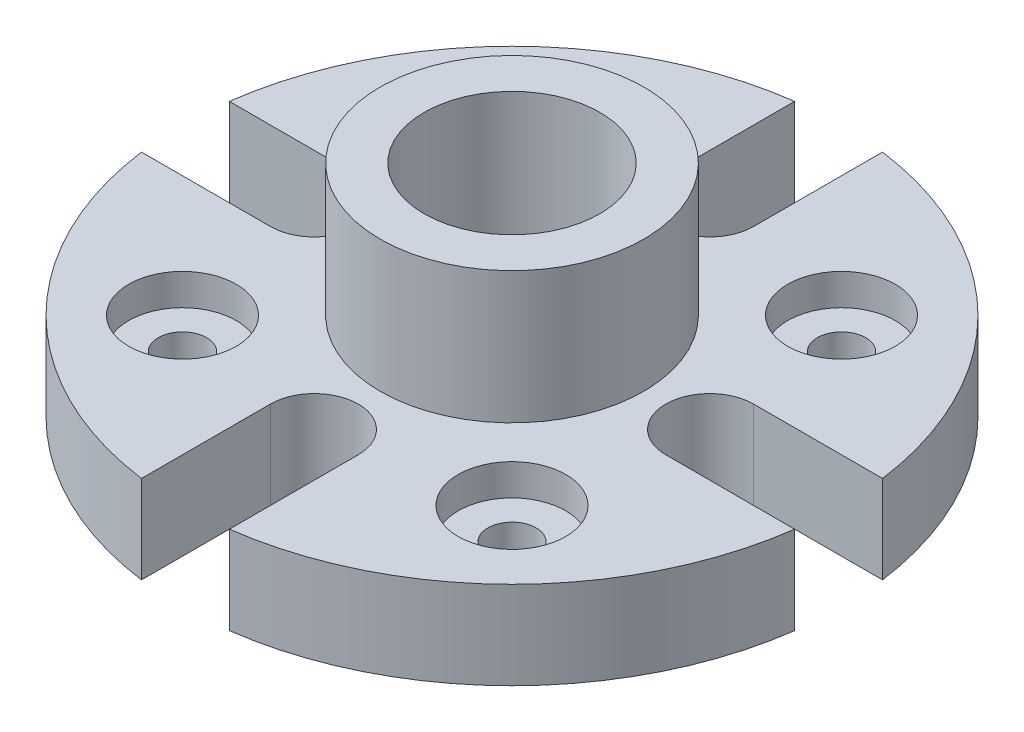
ISO-10303-21;
HEADER;
FILE_DESCRIPTION(('STEP AP214'),'2;1');
FILE_NAME('part.step','',(''),(''),'','','');
FILE_SCHEMA(('AUTOMOTIVE_DESIGN { 1 0 10303 214 1 1 1 1 }'));
ENDSEC;
DATA;
#1=APPLICATION_CONTEXT('core data for automotive mechanical design processes');
#2=APPLICATION_PROTOCOL_DEFINITION('international standard','automotive_design',2000,#1);
#3=PRODUCT_CONTEXT('',#1,'mechanical');
#4=PRODUCT('Part','Part','',(#3));
#5=PRODUCT_RELATED_PRODUCT_CATEGORY('part','',(#4));
#6=PRODUCT_DEFINITION_FORMATION('','',#4);
#7=PRODUCT_DEFINITION_CONTEXT('part definition',#1,'design');
#8=PRODUCT_DEFINITION('design','',#6,#7);
#9=PRODUCT_DEFINITION_SHAPE('','',#8);
#10=(LENGTH_UNIT() NAMED_UNIT(*) SI_UNIT(.MILLI.,.METRE.));
#11=(NAMED_UNIT(*) PLANE_ANGLE_UNIT() SI_UNIT($,.RADIAN.));
#12=(NAMED_UNIT(*) SI_UNIT($,.STERADIAN.) SOLID_ANGLE_UNIT());
#13=UNCERTAINTY_MEASURE_WITH_UNIT(LENGTH_MEASURE(1.E-05),#10,'distance_accuracy_value','');
#14=(GEOMETRIC_REPRESENTATION_CONTEXT(3) GLOBAL_UNCERTAINTY_ASSIGNED_CONTEXT((#13)) GLOBAL_UNIT_ASSIGNED_CONTEXT((#10,
#11,#12)) REPRESENTATION_CONTEXT('',''));
#15=CARTESIAN_POINT('',(0.,0.,0.));
#16=DIRECTION('',(0.,0.,1.));
#17=DIRECTION('',(1.,0.,0.));
#18=AXIS2_PLACEMENT_3D('',#15,#16,#17);
#19=CARTESIAN_POINT('',(0.,10.,0.));
#20=DIRECTION('',(0.,-1.,0.));
#21=DIRECTION('',(0.,0.,-1.));
#22=AXIS2_PLACEMENT_3D('',#19,#20,#21);
#23=CYLINDRICAL_SURFACE('',#22,37.5);
#24=CARTESIAN_POINT('',(0.,0.,0.));
#25=DIRECTION('',(0.,1.,0.));
#26=DIRECTION('',(0.,0.,1.));
#27=AXIS2_PLACEMENT_3D('',#24,#25,#26);
#28=CIRCLE('',#27,37.5);
#29=CARTESIAN_POINT('',(-5.,0.,-37.1651718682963));
#30=VERTEX_POINT('',#29);
#31=CARTESIAN_POINT('',(-37.1651718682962,0.,-5.00000000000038));
#32=VERTEX_POINT('',#31);
#33=EDGE_CURVE('E183',#30,#32,#28,.T.);
#34=ORIENTED_EDGE('',*,*,#33,.T.);
#35=DIRECTION('',(0.,1.,0.));
#36=VECTOR('',#35,1.);
#37=CARTESIAN_POINT('',(-37.1651718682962,0.,-5.00000000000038));
#38=LINE('',#37,#36);
#39=CARTESIAN_POINT('',(-37.1651718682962,10.,-5.00000000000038));
#40=VERTEX_POINT('',#39);
#41=EDGE_CURVE('E297',#32,#40,#38,.T.);
#42=ORIENTED_EDGE('',*,*,#41,.T.);
#43=CARTESIAN_POINT('',(0.,10.,0.));
#44=DIRECTION('',(0.,1.,0.));
#45=DIRECTION('',(0.,0.,1.));
#46=AXIS2_PLACEMENT_3D('',#43,#44,#45);
#47=CIRCLE('',#46,37.5);
#48=CARTESIAN_POINT('',(-5.,10.,-37.1651718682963));
#49=VERTEX_POINT('',#48);
#50=EDGE_CURVE('E11',#49,#40,#47,.T.);
#51=ORIENTED_EDGE('',*,*,#50,.F.);
#52=DIRECTION('',(0.,1.,0.));
#53=VECTOR('',#52,1.);
#54=CARTESIAN_POINT('',(-5.,0.,-37.1651718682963));
#55=LINE('',#54,#53);
#56=EDGE_CURVE('E214',#30,#49,#55,.T.);
#57=ORIENTED_EDGE('',*,*,#56,.F.);
#58=EDGE_LOOP('',(#34,#42,#51,#57));
#59=FACE_BOUND('',#58,.T.);
#60=ADVANCED_FACE('F37',(#59),#23,.T.);
#61=CARTESIAN_POINT('',(-37.1651718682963,10.,4.99999999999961));
#62=VERTEX_POINT('',#61);
#63=CARTESIAN_POINT('',(-5.00000000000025,10.,37.1651718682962));
#64=VERTEX_POINT('',#63);
#65=EDGE_CURVE('E45',#62,#64,#47,.T.);
#66=ORIENTED_EDGE('',*,*,#65,.F.);
#67=DIRECTION('',(0.,1.,0.));
#68=VECTOR('',#67,1.);
#69=CARTESIAN_POINT('',(-37.1651718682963,0.,4.99999999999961));
#70=LINE('',#69,#68);
#71=CARTESIAN_POINT('',(-37.1651718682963,0.,4.99999999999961));
#72=VERTEX_POINT('',#71);
#73=EDGE_CURVE('E151',#72,#62,#70,.T.);
#74=ORIENTED_EDGE('',*,*,#73,.F.);
#75=CARTESIAN_POINT('',(-5.00000000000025,0.,37.1651718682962));
#76=VERTEX_POINT('',#75);
#77=EDGE_CURVE('E189',#72,#76,#28,.T.);
#78=ORIENTED_EDGE('',*,*,#77,.T.);
#79=DIRECTION('',(0.,1.,0.));
#80=VECTOR('',#79,1.);
#81=CARTESIAN_POINT('',(-5.00000000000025,0.,37.1651718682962));
#82=LINE('',#81,#80);
#83=EDGE_CURVE('E177',#76,#64,#82,.T.);
#84=ORIENTED_EDGE('',*,*,#83,.T.);
#85=EDGE_LOOP('',(#66,#74,#78,#84));
#86=FACE_BOUND('',#85,.T.);
#87=ADVANCED_FACE('F175',(#86),#23,.T.);
#88=CARTESIAN_POINT('',(4.99999999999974,10.,37.1651718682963));
#89=VERTEX_POINT('',#88);
#90=CARTESIAN_POINT('',(37.1651718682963,10.,5.00000000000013));
#91=VERTEX_POINT('',#90);
#92=EDGE_CURVE('E178',#89,#91,#47,.T.);
#93=ORIENTED_EDGE('',*,*,#92,.F.);
#94=DIRECTION('',(0.,1.,0.));
#95=VECTOR('',#94,1.);
#96=CARTESIAN_POINT('',(4.99999999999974,0.,37.1651718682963));
#97=LINE('',#96,#95);
#98=CARTESIAN_POINT('',(4.99999999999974,0.,37.1651718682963));
#99=VERTEX_POINT('',#98);
#100=EDGE_CURVE('E276',#99,#89,#97,.T.);
#101=ORIENTED_EDGE('',*,*,#100,.F.);
#102=CARTESIAN_POINT('',(37.1651718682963,0.,5.00000000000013));
#103=VERTEX_POINT('',#102);
#104=EDGE_CURVE('E195',#99,#103,#28,.T.);
#105=ORIENTED_EDGE('',*,*,#104,.T.);
#106=DIRECTION('',(0.,1.,0.));
#107=VECTOR('',#106,1.);
#108=CARTESIAN_POINT('',(37.1651718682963,0.,5.00000000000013));
#109=LINE('',#108,#107);
#110=EDGE_CURVE('E250',#103,#91,#109,.T.);
#111=ORIENTED_EDGE('',*,*,#110,.T.);
#112=EDGE_LOOP('',(#93,#101,#105,#111));
#113=FACE_BOUND('',#112,.T.);
#114=ADVANCED_FACE('F374',(#113),#23,.T.);
#115=CARTESIAN_POINT('',(0.,10.,0.));
#116=DIRECTION('',(0.,1.,0.));
#117=DIRECTION('',(0.,0.,1.));
#118=AXIS2_PLACEMENT_3D('',#115,#116,#117);
#119=PLANE('',#118);
#120=CARTESIAN_POINT('',(-18.7500000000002,10.,18.7499999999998));
#121=DIRECTION('',(0.,1.,0.));
#122=DIRECTION('',(0.,0.,1.));
#123=AXIS2_PLACEMENT_3D('',#120,#121,#122);
#124=CIRCLE('',#123,6.12);
#125=CARTESIAN_POINT('',(-18.7500000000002,10.,24.8699999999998));
#126=VERTEX_POINT('',#125);
#127=EDGE_CURVE('E333',#126,#126,#124,.T.);
#128=ORIENTED_EDGE('',*,*,#127,.F.);
#129=EDGE_LOOP('',(#128));
#130=FACE_BOUND('',#129,.T.);
#131=CARTESIAN_POINT('',(18.7499999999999,10.,18.7500000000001));
#132=DIRECTION('',(0.,1.,0.));
#133=DIRECTION('',(0.,0.,1.));
#134=AXIS2_PLACEMENT_3D('',#131,#132,#133);
#135=CIRCLE('',#134,6.12);
#136=CARTESIAN_POINT('',(18.7499999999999,10.,24.8700000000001));
#137=VERTEX_POINT('',#136);
#138=EDGE_CURVE('E321',#137,#137,#135,.T.);
#139=ORIENTED_EDGE('',*,*,#138,.F.);
#140=EDGE_LOOP('',(#139));
#141=FACE_BOUND('',#140,.T.);
#142=CARTESIAN_POINT('',(18.7500000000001,10.,-18.7499999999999));
#143=DIRECTION('',(0.,1.,0.));
#144=DIRECTION('',(0.,0.,1.));
#145=AXIS2_PLACEMENT_3D('',#142,#143,#144);
#146=CIRCLE('',#145,6.12);
#147=CARTESIAN_POINT('',(18.7500000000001,10.,-12.6299999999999));
#148=VERTEX_POINT('',#147);
#149=EDGE_CURVE('E172',#148,#148,#146,.T.);
#150=ORIENTED_EDGE('',*,*,#149,.F.);
#151=EDGE_LOOP('',(#150));
#152=FACE_BOUND('',#151,.T.);
#153=DIRECTION('',(-1.,0.,0.));
#154=VECTOR('',#153,1.);
#155=CARTESIAN_POINT('',(-37.1651718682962,10.,-5.00000000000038));
#156=LINE('',#155,#154);
#157=CARTESIAN_POINT('',(-22.5,10.,-5.00000000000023));
#158=VERTEX_POINT('',#157);
#159=EDGE_CURVE('E307',#158,#40,#156,.T.);
#160=ORIENTED_EDGE('',*,*,#159,.F.);
#161=CARTESIAN_POINT('',(-22.5,10.,-2.32919762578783E-13));
#162=DIRECTION('',(0.,1.,0.));
#163=DIRECTION('',(1.,0.,0.));
#164=AXIS2_PLACEMENT_3D('',#161,#162,#163);
#165=CIRCLE('',#164,5.);
#166=CARTESIAN_POINT('',(-22.5000000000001,10.,4.99999999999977));
#167=VERTEX_POINT('',#166);
#168=EDGE_CURVE('E171',#167,#158,#165,.T.);
#169=ORIENTED_EDGE('',*,*,#168,.F.);
#170=DIRECTION('',(1.,0.,0.));
#171=VECTOR('',#170,1.);
#172=CARTESIAN_POINT('',(-37.1651718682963,10.,4.99999999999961));
#173=LINE('',#172,#171);
#174=EDGE_CURVE('E154',#62,#167,#173,.T.);
#175=ORIENTED_EDGE('',*,*,#174,.F.);
#176=ORIENTED_EDGE('',*,*,#65,.T.);
#177=DIRECTION('',(0.,0.,1.));
#178=VECTOR('',#177,1.);
#179=CARTESIAN_POINT('',(-5.00000000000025,10.,37.1651718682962));
#180=LINE('',#179,#178);
#181=CARTESIAN_POINT('',(-5.00000000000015,10.,22.5));
#182=VERTEX_POINT('',#181);
#183=EDGE_CURVE('E290',#182,#64,#180,.T.);
#184=ORIENTED_EDGE('',*,*,#183,.F.);
#185=CARTESIAN_POINT('',(-1.54361386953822E-13,10.,22.5));
#186=DIRECTION('',(0.,1.,0.));
#187=DIRECTION('',(0.,0.,-1.));
#188=AXIS2_PLACEMENT_3D('',#185,#186,#187);
#189=CIRCLE('',#188,5.);
#190=CARTESIAN_POINT('',(4.99999999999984,10.,22.5));
#191=VERTEX_POINT('',#190);
#192=EDGE_CURVE('E292',#191,#182,#189,.T.);
#193=ORIENTED_EDGE('',*,*,#192,.F.);
#194=DIRECTION('',(0.,0.,-1.));
#195=VECTOR('',#194,1.);
#196=CARTESIAN_POINT('',(4.99999999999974,10.,37.1651718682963));
#197=LINE('',#196,#195);
#198=EDGE_CURVE('E295',#89,#191,#197,.T.);
#199=ORIENTED_EDGE('',*,*,#198,.F.);
#200=ORIENTED_EDGE('',*,*,#92,.T.);
#201=DIRECTION('',(1.,0.,0.));
#202=VECTOR('',#201,1.);
#203=CARTESIAN_POINT('',(37.1651718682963,10.,5.00000000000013));
#204=LINE('',#203,#202);
#205=CARTESIAN_POINT('',(22.5,10.,5.00000000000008));
#206=VERTEX_POINT('',#205);
#207=EDGE_CURVE('E268',#206,#91,#204,.T.);
#208=ORIENTED_EDGE('',*,*,#207,.F.);
#209=CARTESIAN_POINT('',(22.5,10.,0.));
#210=DIRECTION('',(0.,1.,0.));
#211=DIRECTION('',(-1.,0.,0.));
#212=AXIS2_PLACEMENT_3D('',#209,#210,#211);
#213=CIRCLE('',#212,5.);
#214=CARTESIAN_POINT('',(22.5,10.,-4.99999999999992));
#215=VERTEX_POINT('',#214);
#216=EDGE_CURVE('E270',#215,#206,#213,.T.);
#217=ORIENTED_EDGE('',*,*,#216,.F.);
#218=DIRECTION('',(-1.,0.,0.));
#219=VECTOR('',#218,1.);
#220=CARTESIAN_POINT('',(37.1651718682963,10.,-4.99999999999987));
#221=LINE('',#220,#219);
#222=CARTESIAN_POINT('',(37.1651718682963,10.,-4.99999999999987));
#223=VERTEX_POINT('',#222);
#224=EDGE_CURVE('E273',#223,#215,#221,.T.);
#225=ORIENTED_EDGE('',*,*,#224,.F.);
#226=CARTESIAN_POINT('',(4.99999999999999,10.,-37.1651718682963));
#227=VERTEX_POINT('',#226);
#228=EDGE_CURVE('E46',#223,#227,#47,.T.);
#229=ORIENTED_EDGE('',*,*,#228,.T.);
#230=DIRECTION('',(0.,0.,-1.));
#231=VECTOR('',#230,1.);
#232=CARTESIAN_POINT('',(4.99999999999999,10.,-37.1651718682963));
#233=LINE('',#232,#231);
#234=CARTESIAN_POINT('',(5.,10.,-22.5));
#235=VERTEX_POINT('',#234);
#236=EDGE_CURVE('E230',#235,#227,#233,.T.);
#237=ORIENTED_EDGE('',*,*,#236,.F.);
#238=CARTESIAN_POINT('',(0.,10.,-22.5));
#239=DIRECTION('',(0.,1.,0.));
#240=DIRECTION('',(0.,0.,1.));
#241=AXIS2_PLACEMENT_3D('',#238,#239,#240);
#242=CIRCLE('',#241,5.);
#243=CARTESIAN_POINT('',(-5.,10.,-22.5));
#244=VERTEX_POINT('',#243);
#245=EDGE_CURVE('E232',#244,#235,#242,.T.);
#246=ORIENTED_EDGE('',*,*,#245,.F.);
#247=DIRECTION('',(0.,0.,1.));
#248=VECTOR('',#247,1.);
#249=CARTESIAN_POINT('',(-5.,10.,-37.1651718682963));
#250=LINE('',#249,#248);
#251=EDGE_CURVE('E235',#49,#244,#250,.T.);
#252=ORIENTED_EDGE('',*,*,#251,.F.);
#253=ORIENTED_EDGE('',*,*,#50,.T.);
#254=EDGE_LOOP('',(#160,#169,#175,#176,#184,#193,#199,#200,#208,#217,#225,#229,#237,#246,#252,#253));
#255=FACE_BOUND('',#254,.T.);
#256=CARTESIAN_POINT('',(-18.75,10.,-18.75));
#257=DIRECTION('',(0.,1.,0.));
#258=DIRECTION('',(0.,0.,1.));
#259=AXIS2_PLACEMENT_3D('',#256,#257,#258);
#260=CIRCLE('',#259,6.12);
#261=CARTESIAN_POINT('',(-18.75,10.,-12.63));
#262=VERTEX_POINT('',#261);
#263=EDGE_CURVE('E238',#262,#262,#260,.T.);
#264=ORIENTED_EDGE('',*,*,#263,.F.);
#265=EDGE_LOOP('',(#264));
#266=FACE_BOUND('',#265,.T.);
#267=CARTESIAN_POINT('',(0.,10.,0.));
#268=DIRECTION('',(0.,1.,0.));
#269=DIRECTION('',(0.,0.,1.));
#270=AXIS2_PLACEMENT_3D('',#267,#268,#269);
#271=CIRCLE('',#270,15.);
#272=CARTESIAN_POINT('',(0.,10.,15.));
#273=VERTEX_POINT('',#272);
#274=EDGE_CURVE('E204',#273,#273,#271,.T.);
#275=ORIENTED_EDGE('',*,*,#274,.F.);
#276=EDGE_LOOP('',(#275));
#277=FACE_BOUND('',#276,.T.);
#278=ADVANCED_FACE('F166',(#130,#141,#152,#255,#266,#277),#119,.T.);
#279=ORIENTED_EDGE('',*,*,#228,.F.);
#280=DIRECTION('',(0.,1.,0.));
#281=VECTOR('',#280,1.);
#282=CARTESIAN_POINT('',(37.1651718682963,0.,-4.99999999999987));
#283=LINE('',#282,#281);
#284=CARTESIAN_POINT('',(37.1651718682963,0.,-4.99999999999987));
#285=VERTEX_POINT('',#284);
#286=EDGE_CURVE('E251',#285,#223,#283,.T.);
#287=ORIENTED_EDGE('',*,*,#286,.F.);
#288=CARTESIAN_POINT('',(4.99999999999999,0.,-37.1651718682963));
#289=VERTEX_POINT('',#288);
#290=EDGE_CURVE('E190',#285,#289,#28,.T.);
#291=ORIENTED_EDGE('',*,*,#290,.T.);
#292=DIRECTION('',(0.,1.,0.));
#293=VECTOR('',#292,1.);
#294=CARTESIAN_POINT('',(4.99999999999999,0.,-37.1651718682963));
#295=LINE('',#294,#293);
#296=EDGE_CURVE('E213',#289,#227,#295,.T.);
#297=ORIENTED_EDGE('',*,*,#296,.T.);
#298=EDGE_LOOP('',(#279,#287,#291,#297));
#299=FACE_BOUND('',#298,.T.);
#300=ADVANCED_FACE('F39',(#299),#23,.T.);
#301=CARTESIAN_POINT('',(0.,0.,0.));
#302=DIRECTION('',(0.,1.,0.));
#303=DIRECTION('',(0.,0.,1.));
#304=AXIS2_PLACEMENT_3D('',#301,#302,#303);
#305=PLANE('',#304);
#306=CARTESIAN_POINT('',(0.,0.,0.));
#307=DIRECTION('',(0.,1.,0.));
#308=DIRECTION('',(0.,0.,1.));
#309=AXIS2_PLACEMENT_3D('',#306,#307,#308);
#310=CIRCLE('',#309,10.);
#311=CARTESIAN_POINT('',(0.,0.,10.));
#312=VERTEX_POINT('',#311);
#313=EDGE_CURVE('E345',#312,#312,#310,.T.);
#314=ORIENTED_EDGE('',*,*,#313,.T.);
#315=EDGE_LOOP('',(#314));
#316=FACE_BOUND('',#315,.T.);
#317=CARTESIAN_POINT('',(-18.7500000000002,0.,18.7499999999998));
#318=DIRECTION('',(0.,1.,0.));
#319=DIRECTION('',(0.,0.,1.));
#320=AXIS2_PLACEMENT_3D('',#317,#318,#319);
#321=CIRCLE('',#320,2.75);
#322=CARTESIAN_POINT('',(-18.7500000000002,0.,21.4999999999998));
#323=VERTEX_POINT('',#322);
#324=EDGE_CURVE('E342',#323,#323,#321,.T.);
#325=ORIENTED_EDGE('',*,*,#324,.T.);
#326=EDGE_LOOP('',(#325));
#327=FACE_BOUND('',#326,.T.);
#328=CARTESIAN_POINT('',(18.7499999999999,0.,18.7500000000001));
#329=DIRECTION('',(0.,1.,0.));
#330=DIRECTION('',(0.,0.,1.));
#331=AXIS2_PLACEMENT_3D('',#328,#329,#330);
#332=CIRCLE('',#331,2.75);
#333=CARTESIAN_POINT('',(18.7499999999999,0.,21.5000000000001));
#334=VERTEX_POINT('',#333);
#335=EDGE_CURVE('E330',#334,#334,#332,.T.);
#336=ORIENTED_EDGE('',*,*,#335,.T.);
#337=EDGE_LOOP('',(#336));
#338=FACE_BOUND('',#337,.T.);
#339=CARTESIAN_POINT('',(18.7500000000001,0.,-18.7499999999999));
#340=DIRECTION('',(0.,1.,0.));
#341=DIRECTION('',(0.,0.,1.));
#342=AXIS2_PLACEMENT_3D('',#339,#340,#341);
#343=CIRCLE('',#342,2.75);
#344=CARTESIAN_POINT('',(18.7500000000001,0.,-15.9999999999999));
#345=VERTEX_POINT('',#344);
#346=EDGE_CURVE('E318',#345,#345,#343,.T.);
#347=ORIENTED_EDGE('',*,*,#346,.T.);
#348=EDGE_LOOP('',(#347));
#349=FACE_BOUND('',#348,.T.);
#350=CARTESIAN_POINT('',(-18.75,0.,-18.75));
#351=DIRECTION('',(0.,1.,0.));
#352=DIRECTION('',(0.,0.,1.));
#353=AXIS2_PLACEMENT_3D('',#350,#351,#352);
#354=CIRCLE('',#353,2.75);
#355=CARTESIAN_POINT('',(-18.75,0.,-16.));
#356=VERTEX_POINT('',#355);
#357=EDGE_CURVE('E247',#356,#356,#354,.T.);
#358=ORIENTED_EDGE('',*,*,#357,.T.);
#359=EDGE_LOOP('',(#358));
#360=FACE_BOUND('',#359,.T.);
#361=CARTESIAN_POINT('',(-22.5,0.,-2.32919762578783E-13));
#362=DIRECTION('',(0.,1.,0.));
#363=DIRECTION('',(1.,0.,0.));
#364=AXIS2_PLACEMENT_3D('',#361,#362,#363);
#365=CIRCLE('',#364,5.);
#366=CARTESIAN_POINT('',(-22.5000000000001,0.,4.99999999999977));
#367=VERTEX_POINT('',#366);
#368=CARTESIAN_POINT('',(-22.5,0.,-5.00000000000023));
#369=VERTEX_POINT('',#368);
#370=EDGE_CURVE('E53',#367,#369,#365,.T.);
#371=ORIENTED_EDGE('',*,*,#370,.T.);
#372=DIRECTION('',(-1.,0.,0.));
#373=VECTOR('',#372,1.);
#374=CARTESIAN_POINT('',(-37.1651718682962,0.,-5.00000000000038));
#375=LINE('',#374,#373);
#376=EDGE_CURVE('E162',#369,#32,#375,.T.);
#377=ORIENTED_EDGE('',*,*,#376,.T.);
#378=ORIENTED_EDGE('',*,*,#33,.F.);
#379=DIRECTION('',(0.,0.,1.));
#380=VECTOR('',#379,1.);
#381=CARTESIAN_POINT('',(-5.,0.,-37.1651718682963));
#382=LINE('',#381,#380);
#383=CARTESIAN_POINT('',(-5.,0.,-22.5));
#384=VERTEX_POINT('',#383);
#385=EDGE_CURVE('E227',#30,#384,#382,.T.);
#386=ORIENTED_EDGE('',*,*,#385,.T.);
#387=CARTESIAN_POINT('',(0.,0.,-22.5));
#388=DIRECTION('',(0.,1.,0.));
#389=DIRECTION('',(0.,0.,1.));
#390=AXIS2_PLACEMENT_3D('',#387,#388,#389);
#391=CIRCLE('',#390,5.);
#392=CARTESIAN_POINT('',(5.,0.,-22.5));
#393=VERTEX_POINT('',#392);
#394=EDGE_CURVE('E224',#384,#393,#391,.T.);
#395=ORIENTED_EDGE('',*,*,#394,.T.);
#396=DIRECTION('',(0.,0.,-1.));
#397=VECTOR('',#396,1.);
#398=CARTESIAN_POINT('',(4.99999999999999,0.,-37.1651718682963));
#399=LINE('',#398,#397);
#400=EDGE_CURVE('E217',#393,#289,#399,.T.);
#401=ORIENTED_EDGE('',*,*,#400,.T.);
#402=ORIENTED_EDGE('',*,*,#290,.F.);
#403=DIRECTION('',(-1.,0.,0.));
#404=VECTOR('',#403,1.);
#405=CARTESIAN_POINT('',(37.1651718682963,0.,-4.99999999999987));
#406=LINE('',#405,#404);
#407=CARTESIAN_POINT('',(22.5,0.,-4.99999999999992));
#408=VERTEX_POINT('',#407);
#409=EDGE_CURVE('E265',#285,#408,#406,.T.);
#410=ORIENTED_EDGE('',*,*,#409,.T.);
#411=CARTESIAN_POINT('',(22.5,0.,0.));
#412=DIRECTION('',(0.,1.,0.));
#413=DIRECTION('',(-1.,0.,0.));
#414=AXIS2_PLACEMENT_3D('',#411,#412,#413);
#415=CIRCLE('',#414,5.);
#416=CARTESIAN_POINT('',(22.5,0.,5.00000000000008));
#417=VERTEX_POINT('',#416);
#418=EDGE_CURVE('E262',#408,#417,#415,.T.);
#419=ORIENTED_EDGE('',*,*,#418,.T.);
#420=DIRECTION('',(1.,0.,0.));
#421=VECTOR('',#420,1.);
#422=CARTESIAN_POINT('',(37.1651718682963,0.,5.00000000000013));
#423=LINE('',#422,#421);
#424=EDGE_CURVE('E254',#417,#103,#423,.T.);
#425=ORIENTED_EDGE('',*,*,#424,.T.);
#426=ORIENTED_EDGE('',*,*,#104,.F.);
#427=DIRECTION('',(0.,0.,-1.));
#428=VECTOR('',#427,1.);
#429=CARTESIAN_POINT('',(4.99999999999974,0.,37.1651718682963));
#430=LINE('',#429,#428);
#431=CARTESIAN_POINT('',(4.99999999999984,0.,22.5));
#432=VERTEX_POINT('',#431);
#433=EDGE_CURVE('E287',#99,#432,#430,.T.);
#434=ORIENTED_EDGE('',*,*,#433,.T.);
#435=CARTESIAN_POINT('',(-1.54361386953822E-13,0.,22.5));
#436=DIRECTION('',(0.,1.,0.));
#437=DIRECTION('',(0.,0.,-1.));
#438=AXIS2_PLACEMENT_3D('',#435,#436,#437);
#439=CIRCLE('',#438,5.);
#440=CARTESIAN_POINT('',(-5.00000000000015,0.,22.5));
#441=VERTEX_POINT('',#440);
#442=EDGE_CURVE('E61',#432,#441,#439,.T.);
#443=ORIENTED_EDGE('',*,*,#442,.T.);
#444=DIRECTION('',(0.,0.,1.));
#445=VECTOR('',#444,1.);
#446=CARTESIAN_POINT('',(-5.00000000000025,0.,37.1651718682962));
#447=LINE('',#446,#445);
#448=EDGE_CURVE('E279',#441,#76,#447,.T.);
#449=ORIENTED_EDGE('',*,*,#448,.T.);
#450=ORIENTED_EDGE('',*,*,#77,.F.);
#451=DIRECTION('',(1.,0.,0.));
#452=VECTOR('',#451,1.);
#453=CARTESIAN_POINT('',(-37.1651718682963,0.,4.99999999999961));
#454=LINE('',#453,#452);
#455=EDGE_CURVE('E157',#72,#367,#454,.T.);
#456=ORIENTED_EDGE('',*,*,#455,.T.);
#457=EDGE_LOOP('',(#371,#377,#378,#386,#395,#401,#402,#410,#419,#425,#426,#434,#443,#449,#450,#456));
#458=FACE_BOUND('',#457,.T.);
#459=ADVANCED_FACE('F349',(#316,#327,#338,#349,#360,#458),#305,.F.);
#460=CARTESIAN_POINT('',(0.,25.,0.));
#461=DIRECTION('',(0.,1.,0.));
#462=DIRECTION('',(0.,0.,1.));
#463=AXIS2_PLACEMENT_3D('',#460,#461,#462);
#464=PLANE('',#463);
#465=CARTESIAN_POINT('',(0.,25.,0.));
#466=DIRECTION('',(0.,1.,0.));
#467=DIRECTION('',(0.,0.,1.));
#468=AXIS2_PLACEMENT_3D('',#465,#466,#467);
#469=CIRCLE('',#468,15.);
#470=CARTESIAN_POINT('',(0.,25.,15.));
#471=VERTEX_POINT('',#470);
#472=EDGE_CURVE('E197',#471,#471,#469,.T.);
#473=ORIENTED_EDGE('',*,*,#472,.T.);
#474=EDGE_LOOP('',(#473));
#475=FACE_BOUND('',#474,.T.);
#476=CARTESIAN_POINT('',(0.,25.,0.));
#477=DIRECTION('',(0.,1.,0.));
#478=DIRECTION('',(0.,0.,1.));
#479=AXIS2_PLACEMENT_3D('',#476,#477,#478);
#480=CIRCLE('',#479,10.);
#481=CARTESIAN_POINT('',(0.,25.,10.));
#482=VERTEX_POINT('',#481);
#483=EDGE_CURVE('E208',#482,#482,#480,.T.);
#484=ORIENTED_EDGE('',*,*,#483,.F.);
#485=EDGE_LOOP('',(#484));
#486=FACE_BOUND('',#485,.T.);
#487=ADVANCED_FACE('F365',(#475,#486),#464,.T.);
#488=CARTESIAN_POINT('',(0.,25.,0.));
#489=DIRECTION('',(0.,-1.,0.));
#490=DIRECTION('',(0.,0.,-1.));
#491=AXIS2_PLACEMENT_3D('',#488,#489,#490);
#492=CYLINDRICAL_SURFACE('',#491,15.);
#493=ORIENTED_EDGE('',*,*,#472,.F.);
#494=EDGE_LOOP('',(#493));
#495=FACE_BOUND('',#494,.T.);
#496=ORIENTED_EDGE('',*,*,#274,.T.);
#497=EDGE_LOOP('',(#496));
#498=FACE_BOUND('',#497,.T.);
#499=ADVANCED_FACE('F355',(#495,#498),#492,.T.);
#500=CARTESIAN_POINT('',(0.,25.,0.));
#501=DIRECTION('',(0.,-1.,0.));
#502=DIRECTION('',(0.,0.,-1.));
#503=AXIS2_PLACEMENT_3D('',#500,#501,#502);
#504=CYLINDRICAL_SURFACE('',#503,10.);
#505=ORIENTED_EDGE('',*,*,#483,.T.);
#506=EDGE_LOOP('',(#505));
#507=FACE_BOUND('',#506,.T.);
#508=ORIENTED_EDGE('',*,*,#313,.F.);
#509=EDGE_LOOP('',(#508));
#510=FACE_BOUND('',#509,.T.);
#511=ADVANCED_FACE('F352',(#507,#510),#504,.F.);
#512=CARTESIAN_POINT('',(4.99999999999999,0.,-37.1651718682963));
#513=DIRECTION('',(1.,0.,0.));
#514=DIRECTION('',(0.,0.,-1.));
#515=AXIS2_PLACEMENT_3D('',#512,#513,#514);
#516=PLANE('',#515);
#517=ORIENTED_EDGE('',*,*,#236,.T.);
#518=ORIENTED_EDGE('',*,*,#296,.F.);
#519=ORIENTED_EDGE('',*,*,#400,.F.);
#520=DIRECTION('',(0.,1.,0.));
#521=VECTOR('',#520,1.);
#522=CARTESIAN_POINT('',(5.,0.,-22.5));
#523=LINE('',#522,#521);
#524=EDGE_CURVE('E219',#393,#235,#523,.T.);
#525=ORIENTED_EDGE('',*,*,#524,.T.);
#526=EDGE_LOOP('',(#517,#518,#519,#525));
#527=FACE_BOUND('',#526,.T.);
#528=ADVANCED_FACE('F354',(#527),#516,.F.);
#529=CARTESIAN_POINT('',(0.,0.,-22.5));
#530=DIRECTION('',(0.,1.,0.));
#531=DIRECTION('',(0.,0.,1.));
#532=AXIS2_PLACEMENT_3D('',#529,#530,#531);
#533=CYLINDRICAL_SURFACE('',#532,5.);
#534=ORIENTED_EDGE('',*,*,#245,.T.);
#535=ORIENTED_EDGE('',*,*,#524,.F.);
#536=ORIENTED_EDGE('',*,*,#394,.F.);
#537=DIRECTION('',(0.,1.,0.));
#538=VECTOR('',#537,1.);
#539=CARTESIAN_POINT('',(-5.,0.,-22.5));
#540=LINE('',#539,#538);
#541=EDGE_CURVE('E216',#384,#244,#540,.T.);
#542=ORIENTED_EDGE('',*,*,#541,.T.);
#543=EDGE_LOOP('',(#534,#535,#536,#542));
#544=FACE_BOUND('',#543,.T.);
#545=ADVANCED_FACE('F362',(#544),#533,.F.);
#546=CARTESIAN_POINT('',(-5.,0.,-37.1651718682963));
#547=DIRECTION('',(-1.,0.,0.));
#548=DIRECTION('',(0.,0.,1.));
#549=AXIS2_PLACEMENT_3D('',#546,#547,#548);
#550=PLANE('',#549);
#551=ORIENTED_EDGE('',*,*,#251,.T.);
#552=ORIENTED_EDGE('',*,*,#541,.F.);
#553=ORIENTED_EDGE('',*,*,#385,.F.);
#554=ORIENTED_EDGE('',*,*,#56,.T.);
#555=EDGE_LOOP('',(#551,#552,#553,#554));
#556=FACE_BOUND('',#555,.T.);
#557=ADVANCED_FACE('F403',(#556),#550,.F.);
#558=CARTESIAN_POINT('',(-18.75,10.,-18.75));
#559=DIRECTION('',(0.,1.,0.));
#560=DIRECTION('',(0.,0.,1.));
#561=AXIS2_PLACEMENT_3D('',#558,#559,#560);
#562=CYLINDRICAL_SURFACE('',#561,6.12);
#563=CARTESIAN_POINT('',(-18.75,6.42,-18.75));
#564=DIRECTION('',(0.,1.,0.));
#565=DIRECTION('',(0.,0.,1.));
#566=AXIS2_PLACEMENT_3D('',#563,#564,#565);
#567=CIRCLE('',#566,6.12);
#568=CARTESIAN_POINT('',(-18.75,6.42,-12.63));
#569=VERTEX_POINT('',#568);
#570=EDGE_CURVE('E241',#569,#569,#567,.T.);
#571=ORIENTED_EDGE('',*,*,#570,.F.);
#572=EDGE_LOOP('',(#571));
#573=FACE_BOUND('',#572,.T.);
#574=ORIENTED_EDGE('',*,*,#263,.T.);
#575=EDGE_LOOP('',(#574));
#576=FACE_BOUND('',#575,.T.);
#577=ADVANCED_FACE('F441',(#573,#576),#562,.F.);
#578=CARTESIAN_POINT('',(-16.,6.42,-18.75));
#579=DIRECTION('',(0.,-1.,0.));
#580=DIRECTION('',(0.,0.,-1.));
#581=AXIS2_PLACEMENT_3D('',#578,#579,#580);
#582=PLANE('',#581);
#583=CARTESIAN_POINT('',(-18.75,6.42,-18.75));
#584=DIRECTION('',(0.,1.,0.));
#585=DIRECTION('',(0.,0.,1.));
#586=AXIS2_PLACEMENT_3D('',#583,#584,#585);
#587=CIRCLE('',#586,2.75);
#588=CARTESIAN_POINT('',(-18.75,6.42,-16.));
#589=VERTEX_POINT('',#588);
#590=EDGE_CURVE('E244',#589,#589,#587,.T.);
#591=ORIENTED_EDGE('',*,*,#590,.F.);
#592=EDGE_LOOP('',(#591));
#593=FACE_BOUND('',#592,.T.);
#594=ORIENTED_EDGE('',*,*,#570,.T.);
#595=EDGE_LOOP('',(#594));
#596=FACE_BOUND('',#595,.T.);
#597=ADVANCED_FACE('F437',(#593,#596),#582,.F.);
#598=CARTESIAN_POINT('',(-18.75,10.,-18.75));
#599=DIRECTION('',(0.,1.,0.));
#600=DIRECTION('',(0.,0.,1.));
#601=AXIS2_PLACEMENT_3D('',#598,#599,#600);
#602=CYLINDRICAL_SURFACE('',#601,2.75);
#603=ORIENTED_EDGE('',*,*,#357,.F.);
#604=EDGE_LOOP('',(#603));
#605=FACE_BOUND('',#604,.T.);
#606=ORIENTED_EDGE('',*,*,#590,.T.);
#607=EDGE_LOOP('',(#606));
#608=FACE_BOUND('',#607,.T.);
#609=ADVANCED_FACE('F430',(#605,#608),#602,.F.);
#610=CARTESIAN_POINT('',(37.1651718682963,0.,5.00000000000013));
#611=DIRECTION('',(0.,0.,1.));
#612=DIRECTION('',(1.,0.,0.));
#613=AXIS2_PLACEMENT_3D('',#610,#611,#612);
#614=PLANE('',#613);
#615=ORIENTED_EDGE('',*,*,#207,.T.);
#616=ORIENTED_EDGE('',*,*,#110,.F.);
#617=ORIENTED_EDGE('',*,*,#424,.F.);
#618=DIRECTION('',(0.,1.,0.));
#619=VECTOR('',#618,1.);
#620=CARTESIAN_POINT('',(22.5,0.,5.00000000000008));
#621=LINE('',#620,#619);
#622=EDGE_CURVE('E256',#417,#206,#621,.T.);
#623=ORIENTED_EDGE('',*,*,#622,.T.);
#624=EDGE_LOOP('',(#615,#616,#617,#623));
#625=FACE_BOUND('',#624,.T.);
#626=ADVANCED_FACE('F391',(#625),#614,.F.);
#627=CARTESIAN_POINT('',(22.5,0.,0.));
#628=DIRECTION('',(0.,1.,0.));
#629=DIRECTION('',(0.,0.,1.));
#630=AXIS2_PLACEMENT_3D('',#627,#628,#629);
#631=CYLINDRICAL_SURFACE('',#630,5.);
#632=ORIENTED_EDGE('',*,*,#216,.T.);
#633=ORIENTED_EDGE('',*,*,#622,.F.);
#634=ORIENTED_EDGE('',*,*,#418,.F.);
#635=DIRECTION('',(0.,1.,0.));
#636=VECTOR('',#635,1.);
#637=CARTESIAN_POINT('',(22.5,0.,-4.99999999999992));
#638=LINE('',#637,#636);
#639=EDGE_CURVE('E253',#408,#215,#638,.T.);
#640=ORIENTED_EDGE('',*,*,#639,.T.);
#641=EDGE_LOOP('',(#632,#633,#634,#640));
#642=FACE_BOUND('',#641,.T.);
#643=ADVANCED_FACE('F395',(#642),#631,.F.);
#644=CARTESIAN_POINT('',(37.1651718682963,0.,-4.99999999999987));
#645=DIRECTION('',(0.,0.,-1.));
#646=DIRECTION('',(-1.,0.,0.));
#647=AXIS2_PLACEMENT_3D('',#644,#645,#646);
#648=PLANE('',#647);
#649=ORIENTED_EDGE('',*,*,#224,.T.);
#650=ORIENTED_EDGE('',*,*,#639,.F.);
#651=ORIENTED_EDGE('',*,*,#409,.F.);
#652=ORIENTED_EDGE('',*,*,#286,.T.);
#653=EDGE_LOOP('',(#649,#650,#651,#652));
#654=FACE_BOUND('',#653,.T.);
#655=ADVANCED_FACE('F397',(#654),#648,.F.);
#656=CARTESIAN_POINT('',(-5.00000000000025,0.,37.1651718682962));
#657=DIRECTION('',(-1.,0.,0.));
#658=DIRECTION('',(0.,0.,1.));
#659=AXIS2_PLACEMENT_3D('',#656,#657,#658);
#660=PLANE('',#659);
#661=ORIENTED_EDGE('',*,*,#183,.T.);
#662=ORIENTED_EDGE('',*,*,#83,.F.);
#663=ORIENTED_EDGE('',*,*,#448,.F.);
#664=DIRECTION('',(0.,1.,0.));
#665=VECTOR('',#664,1.);
#666=CARTESIAN_POINT('',(-5.00000000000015,0.,22.5));
#667=LINE('',#666,#665);
#668=EDGE_CURVE('E281',#441,#182,#667,.T.);
#669=ORIENTED_EDGE('',*,*,#668,.T.);
#670=EDGE_LOOP('',(#661,#662,#663,#669));
#671=FACE_BOUND('',#670,.T.);
#672=ADVANCED_FACE('F412',(#671),#660,.F.);
#673=CARTESIAN_POINT('',(-1.54361386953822E-13,0.,22.5));
#674=DIRECTION('',(0.,1.,0.));
#675=DIRECTION('',(0.,0.,1.));
#676=AXIS2_PLACEMENT_3D('',#673,#674,#675);
#677=CYLINDRICAL_SURFACE('',#676,5.);
#678=ORIENTED_EDGE('',*,*,#192,.T.);
#679=ORIENTED_EDGE('',*,*,#668,.F.);
#680=ORIENTED_EDGE('',*,*,#442,.F.);
#681=DIRECTION('',(0.,1.,0.));
#682=VECTOR('',#681,1.);
#683=CARTESIAN_POINT('',(4.99999999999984,0.,22.5));
#684=LINE('',#683,#682);
#685=EDGE_CURVE('E278',#432,#191,#684,.T.);
#686=ORIENTED_EDGE('',*,*,#685,.T.);
#687=EDGE_LOOP('',(#678,#679,#680,#686));
#688=FACE_BOUND('',#687,.T.);
#689=ADVANCED_FACE('F414',(#688),#677,.F.);
#690=CARTESIAN_POINT('',(4.99999999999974,0.,37.1651718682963));
#691=DIRECTION('',(1.,0.,0.));
#692=DIRECTION('',(0.,0.,-1.));
#693=AXIS2_PLACEMENT_3D('',#690,#691,#692);
#694=PLANE('',#693);
#695=ORIENTED_EDGE('',*,*,#198,.T.);
#696=ORIENTED_EDGE('',*,*,#685,.F.);
#697=ORIENTED_EDGE('',*,*,#433,.F.);
#698=ORIENTED_EDGE('',*,*,#100,.T.);
#699=EDGE_LOOP('',(#695,#696,#697,#698));
#700=FACE_BOUND('',#699,.T.);
#701=ADVANCED_FACE('F416',(#700),#694,.F.);
#702=CARTESIAN_POINT('',(-37.1651718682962,0.,-5.00000000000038));
#703=DIRECTION('',(0.,0.,-1.));
#704=DIRECTION('',(-1.,0.,0.));
#705=AXIS2_PLACEMENT_3D('',#702,#703,#704);
#706=PLANE('',#705);
#707=ORIENTED_EDGE('',*,*,#159,.T.);
#708=ORIENTED_EDGE('',*,*,#41,.F.);
#709=ORIENTED_EDGE('',*,*,#376,.F.);
#710=DIRECTION('',(0.,1.,0.));
#711=VECTOR('',#710,1.);
#712=CARTESIAN_POINT('',(-22.5,0.,-5.00000000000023));
#713=LINE('',#712,#711);
#714=EDGE_CURVE('E300',#369,#158,#713,.T.);
#715=ORIENTED_EDGE('',*,*,#714,.T.);
#716=EDGE_LOOP('',(#707,#708,#709,#715));
#717=FACE_BOUND('',#716,.T.);
#718=ADVANCED_FACE('F409',(#717),#706,.F.);
#719=CARTESIAN_POINT('',(-22.5,0.,-2.32919762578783E-13));
#720=DIRECTION('',(0.,1.,0.));
#721=DIRECTION('',(0.,0.,1.));
#722=AXIS2_PLACEMENT_3D('',#719,#720,#721);
#723=CYLINDRICAL_SURFACE('',#722,5.);
#724=ORIENTED_EDGE('',*,*,#168,.T.);
#725=ORIENTED_EDGE('',*,*,#714,.F.);
#726=ORIENTED_EDGE('',*,*,#370,.F.);
#727=DIRECTION('',(0.,1.,0.));
#728=VECTOR('',#727,1.);
#729=CARTESIAN_POINT('',(-22.5000000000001,0.,4.99999999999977));
#730=LINE('',#729,#728);
#731=EDGE_CURVE('E161',#367,#167,#730,.T.);
#732=ORIENTED_EDGE('',*,*,#731,.T.);
#733=EDGE_LOOP('',(#724,#725,#726,#732));
#734=FACE_BOUND('',#733,.T.);
#735=ADVANCED_FACE('F423',(#734),#723,.F.);
#736=CARTESIAN_POINT('',(-37.1651718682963,0.,4.99999999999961));
#737=DIRECTION('',(0.,0.,1.));
#738=DIRECTION('',(1.,0.,0.));
#739=AXIS2_PLACEMENT_3D('',#736,#737,#738);
#740=PLANE('',#739);
#741=ORIENTED_EDGE('',*,*,#174,.T.);
#742=ORIENTED_EDGE('',*,*,#731,.F.);
#743=ORIENTED_EDGE('',*,*,#455,.F.);
#744=ORIENTED_EDGE('',*,*,#73,.T.);
#745=EDGE_LOOP('',(#741,#742,#743,#744));
#746=FACE_BOUND('',#745,.T.);
#747=ADVANCED_FACE('F153',(#746),#740,.F.);
#748=CARTESIAN_POINT('',(18.7500000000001,10.,-18.7499999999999));
#749=DIRECTION('',(0.,1.,0.));
#750=DIRECTION('',(0.,0.,1.));
#751=AXIS2_PLACEMENT_3D('',#748,#749,#750);
#752=CYLINDRICAL_SURFACE('',#751,6.12);
#753=CARTESIAN_POINT('',(18.7500000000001,6.42,-18.7499999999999));
#754=DIRECTION('',(0.,1.,0.));
#755=DIRECTION('',(0.,0.,1.));
#756=AXIS2_PLACEMENT_3D('',#753,#754,#755);
#757=CIRCLE('',#756,6.12);
#758=CARTESIAN_POINT('',(18.7500000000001,6.42,-12.6299999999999));
#759=VERTEX_POINT('',#758);
#760=EDGE_CURVE('E312',#759,#759,#757,.T.);
#761=ORIENTED_EDGE('',*,*,#760,.F.);
#762=EDGE_LOOP('',(#761));
#763=FACE_BOUND('',#762,.T.);
#764=ORIENTED_EDGE('',*,*,#149,.T.);
#765=EDGE_LOOP('',(#764));
#766=FACE_BOUND('',#765,.T.);
#767=ADVANCED_FACE('F512',(#763,#766),#752,.F.);
#768=CARTESIAN_POINT('',(21.5000000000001,6.42,-18.7499999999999));
#769=DIRECTION('',(0.,-1.,0.));
#770=DIRECTION('',(0.,0.,-1.));
#771=AXIS2_PLACEMENT_3D('',#768,#769,#770);
#772=PLANE('',#771);
#773=CARTESIAN_POINT('',(18.7500000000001,6.42,-18.7499999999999));
#774=DIRECTION('',(0.,1.,0.));
#775=DIRECTION('',(0.,0.,1.));
#776=AXIS2_PLACEMENT_3D('',#773,#774,#775);
#777=CIRCLE('',#776,2.75);
#778=CARTESIAN_POINT('',(18.7500000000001,6.42,-15.9999999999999));
#779=VERTEX_POINT('',#778);
#780=EDGE_CURVE('E315',#779,#779,#777,.T.);
#781=ORIENTED_EDGE('',*,*,#780,.F.);
#782=EDGE_LOOP('',(#781));
#783=FACE_BOUND('',#782,.T.);
#784=ORIENTED_EDGE('',*,*,#760,.T.);
#785=EDGE_LOOP('',(#784));
#786=FACE_BOUND('',#785,.T.);
#787=ADVANCED_FACE('F521',(#783,#786),#772,.F.);
#788=CARTESIAN_POINT('',(18.7500000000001,10.,-18.7499999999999));
#789=DIRECTION('',(0.,1.,0.));
#790=DIRECTION('',(0.,0.,1.));
#791=AXIS2_PLACEMENT_3D('',#788,#789,#790);
#792=CYLINDRICAL_SURFACE('',#791,2.75);
#793=ORIENTED_EDGE('',*,*,#346,.F.);
#794=EDGE_LOOP('',(#793));
#795=FACE_BOUND('',#794,.T.);
#796=ORIENTED_EDGE('',*,*,#780,.T.);
#797=EDGE_LOOP('',(#796));
#798=FACE_BOUND('',#797,.T.);
#799=ADVANCED_FACE('F531',(#795,#798),#792,.F.);
#800=CARTESIAN_POINT('',(18.7499999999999,10.,18.7500000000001));
#801=DIRECTION('',(0.,1.,0.));
#802=DIRECTION('',(0.,0.,1.));
#803=AXIS2_PLACEMENT_3D('',#800,#801,#802);
#804=CYLINDRICAL_SURFACE('',#803,6.12);
#805=CARTESIAN_POINT('',(18.7499999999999,6.42,18.7500000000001));
#806=DIRECTION('',(0.,1.,0.));
#807=DIRECTION('',(0.,0.,1.));
#808=AXIS2_PLACEMENT_3D('',#805,#806,#807);
#809=CIRCLE('',#808,6.12);
#810=CARTESIAN_POINT('',(18.7499999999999,6.42,24.8700000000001));
#811=VERTEX_POINT('',#810);
#812=EDGE_CURVE('E324',#811,#811,#809,.T.);
#813=ORIENTED_EDGE('',*,*,#812,.F.);
#814=EDGE_LOOP('',(#813));
#815=FACE_BOUND('',#814,.T.);
#816=ORIENTED_EDGE('',*,*,#138,.T.);
#817=EDGE_LOOP('',(#816));
#818=FACE_BOUND('',#817,.T.);
#819=ADVANCED_FACE('F541',(#815,#818),#804,.F.);
#820=CARTESIAN_POINT('',(21.4999999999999,6.42,18.7500000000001));
#821=DIRECTION('',(0.,-1.,0.));
#822=DIRECTION('',(0.,0.,-1.));
#823=AXIS2_PLACEMENT_3D('',#820,#821,#822);
#824=PLANE('',#823);
#825=CARTESIAN_POINT('',(18.7499999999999,6.42,18.7500000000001));
#826=DIRECTION('',(0.,1.,0.));
#827=DIRECTION('',(0.,0.,1.));
#828=AXIS2_PLACEMENT_3D('',#825,#826,#827);
#829=CIRCLE('',#828,2.75);
#830=CARTESIAN_POINT('',(18.7499999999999,6.42,21.5000000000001));
#831=VERTEX_POINT('',#830);
#832=EDGE_CURVE('E327',#831,#831,#829,.T.);
#833=ORIENTED_EDGE('',*,*,#832,.F.);
#834=EDGE_LOOP('',(#833));
#835=FACE_BOUND('',#834,.T.);
#836=ORIENTED_EDGE('',*,*,#812,.T.);
#837=EDGE_LOOP('',(#836));
#838=FACE_BOUND('',#837,.T.);
#839=ADVANCED_FACE('F551',(#835,#838),#824,.F.);
#840=CARTESIAN_POINT('',(18.7499999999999,10.,18.7500000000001));
#841=DIRECTION('',(0.,1.,0.));
#842=DIRECTION('',(0.,0.,1.));
#843=AXIS2_PLACEMENT_3D('',#840,#841,#842);
#844=CYLINDRICAL_SURFACE('',#843,2.75);
#845=ORIENTED_EDGE('',*,*,#335,.F.);
#846=EDGE_LOOP('',(#845));
#847=FACE_BOUND('',#846,.T.);
#848=ORIENTED_EDGE('',*,*,#832,.T.);
#849=EDGE_LOOP('',(#848));
#850=FACE_BOUND('',#849,.T.);
#851=ADVANCED_FACE('F561',(#847,#850),#844,.F.);
#852=CARTESIAN_POINT('',(-18.7500000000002,10.,18.7499999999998));
#853=DIRECTION('',(0.,1.,0.));
#854=DIRECTION('',(0.,0.,1.));
#855=AXIS2_PLACEMENT_3D('',#852,#853,#854);
#856=CYLINDRICAL_SURFACE('',#855,6.12);
#857=CARTESIAN_POINT('',(-18.7500000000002,6.42,18.7499999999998));
#858=DIRECTION('',(0.,1.,0.));
#859=DIRECTION('',(0.,0.,1.));
#860=AXIS2_PLACEMENT_3D('',#857,#858,#859);
#861=CIRCLE('',#860,6.12);
#862=CARTESIAN_POINT('',(-18.7500000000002,6.42,24.8699999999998));
#863=VERTEX_POINT('',#862);
#864=EDGE_CURVE('E336',#863,#863,#861,.T.);
#865=ORIENTED_EDGE('',*,*,#864,.F.);
#866=EDGE_LOOP('',(#865));
#867=FACE_BOUND('',#866,.T.);
#868=ORIENTED_EDGE('',*,*,#127,.T.);
#869=EDGE_LOOP('',(#868));
#870=FACE_BOUND('',#869,.T.);
#871=ADVANCED_FACE('F571',(#867,#870),#856,.F.);
#872=CARTESIAN_POINT('',(-16.0000000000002,6.42,18.7499999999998));
#873=DIRECTION('',(0.,-1.,0.));
#874=DIRECTION('',(0.,0.,-1.));
#875=AXIS2_PLACEMENT_3D('',#872,#873,#874);
#876=PLANE('',#875);
#877=CARTESIAN_POINT('',(-18.7500000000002,6.42,18.7499999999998));
#878=DIRECTION('',(0.,1.,0.));
#879=DIRECTION('',(0.,0.,1.));
#880=AXIS2_PLACEMENT_3D('',#877,#878,#879);
#881=CIRCLE('',#880,2.75);
#882=CARTESIAN_POINT('',(-18.7500000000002,6.42,21.4999999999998));
#883=VERTEX_POINT('',#882);
#884=EDGE_CURVE('E339',#883,#883,#881,.T.);
#885=ORIENTED_EDGE('',*,*,#884,.F.);
#886=EDGE_LOOP('',(#885));
#887=FACE_BOUND('',#886,.T.);
#888=ORIENTED_EDGE('',*,*,#864,.T.);
#889=EDGE_LOOP('',(#888));
#890=FACE_BOUND('',#889,.T.);
#891=ADVANCED_FACE('F581',(#887,#890),#876,.F.);
#892=CARTESIAN_POINT('',(-18.7500000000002,10.,18.7499999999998));
#893=DIRECTION('',(0.,1.,0.));
#894=DIRECTION('',(0.,0.,1.));
#895=AXIS2_PLACEMENT_3D('',#892,#893,#894);
#896=CYLINDRICAL_SURFACE('',#895,2.75);
#897=ORIENTED_EDGE('',*,*,#324,.F.);
#898=EDGE_LOOP('',(#897));
#899=FACE_BOUND('',#898,.T.);
#900=ORIENTED_EDGE('',*,*,#884,.T.);
#901=EDGE_LOOP('',(#900));
#902=FACE_BOUND('',#901,.T.);
#903=ADVANCED_FACE('F591',(#899,#902),#896,.F.);
#904=CLOSED_SHELL('',(#60,#87,#114,#278,#300,#459,#487,#499,#511,#528,#545,#557,#577,#597,#609,
#626,#643,#655,#672,#689,#701,#718,#735,#747,#767,#787,#799,#819,#839,#851,#871,#891,#903));
#905=MANIFOLD_SOLID_BREP('B2',#904);
#906=ADVANCED_BREP_SHAPE_REPRESENTATION('',(#18,#905),#14);
#907=SHAPE_DEFINITION_REPRESENTATION(#9,#906);
ENDSEC;
END-ISO-10303-21;
